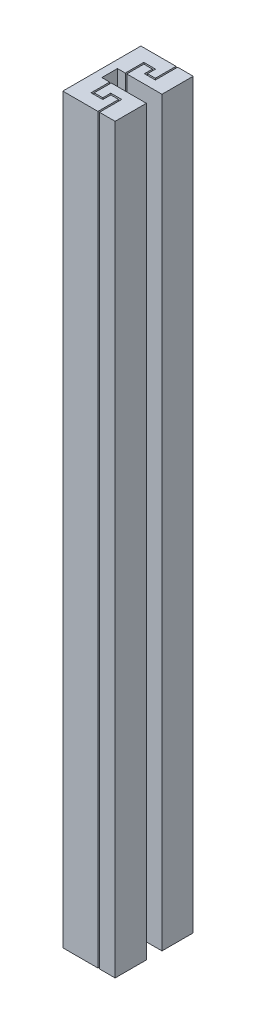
ISO-10303-21;
HEADER;
FILE_DESCRIPTION(('STEP AP214'),'2;1');
FILE_NAME('part.step','',(''),(''),'','','');
FILE_SCHEMA(('AUTOMOTIVE_DESIGN { 1 0 10303 214 1 1 1 1 }'));
ENDSEC;
DATA;
#1=APPLICATION_CONTEXT('core data for automotive mechanical design processes');
#2=APPLICATION_PROTOCOL_DEFINITION('international standard','automotive_design',2000,#1);
#3=PRODUCT_CONTEXT('',#1,'mechanical');
#4=PRODUCT('Part','Part','',(#3));
#5=PRODUCT_RELATED_PRODUCT_CATEGORY('part','',(#4));
#6=PRODUCT_DEFINITION_FORMATION('','',#4);
#7=PRODUCT_DEFINITION_CONTEXT('part definition',#1,'design');
#8=PRODUCT_DEFINITION('design','',#6,#7);
#9=PRODUCT_DEFINITION_SHAPE('','',#8);
#10=(LENGTH_UNIT() NAMED_UNIT(*) SI_UNIT(.MILLI.,.METRE.));
#11=(NAMED_UNIT(*) PLANE_ANGLE_UNIT() SI_UNIT($,.RADIAN.));
#12=(NAMED_UNIT(*) SI_UNIT($,.STERADIAN.) SOLID_ANGLE_UNIT());
#13=UNCERTAINTY_MEASURE_WITH_UNIT(LENGTH_MEASURE(1.E-05),#10,'distance_accuracy_value','');
#14=(GEOMETRIC_REPRESENTATION_CONTEXT(3) GLOBAL_UNCERTAINTY_ASSIGNED_CONTEXT((#13)) GLOBAL_UNIT_ASSIGNED_CONTEXT((#10,
#11,#12)) REPRESENTATION_CONTEXT('',''));
#15=CARTESIAN_POINT('',(0.,0.,0.));
#16=DIRECTION('',(0.,0.,1.));
#17=DIRECTION('',(1.,0.,0.));
#18=AXIS2_PLACEMENT_3D('',#15,#16,#17);
#19=CARTESIAN_POINT('',(-0.127000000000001,241.3,2.54));
#20=DIRECTION('',(0.,0.,1.));
#21=DIRECTION('',(1.,0.,0.));
#22=AXIS2_PLACEMENT_3D('',#19,#20,#21);
#23=PLANE('',#22);
#24=DIRECTION('',(-1.,0.,0.));
#25=VECTOR('',#24,1.);
#26=CARTESIAN_POINT('',(-0.127000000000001,0.,2.54));
#27=LINE('',#26,#25);
#28=CARTESIAN_POINT('',(11.303,0.,2.54));
#29=VERTEX_POINT('',#28);
#30=CARTESIAN_POINT('',(-0.127000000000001,0.,2.54));
#31=VERTEX_POINT('',#30);
#32=EDGE_CURVE('E146',#29,#31,#27,.T.);
#33=ORIENTED_EDGE('',*,*,#32,.T.);
#34=DIRECTION('',(0.,-1.,0.));
#35=VECTOR('',#34,1.);
#36=CARTESIAN_POINT('',(-0.127000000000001,241.3,2.54));
#37=LINE('',#36,#35);
#38=CARTESIAN_POINT('',(-0.127000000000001,241.3,2.54));
#39=VERTEX_POINT('',#38);
#40=EDGE_CURVE('E12',#39,#31,#37,.T.);
#41=ORIENTED_EDGE('',*,*,#40,.F.);
#42=DIRECTION('',(-1.,0.,0.));
#43=VECTOR('',#42,1.);
#44=CARTESIAN_POINT('',(-0.127000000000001,241.3,2.54));
#45=LINE('',#44,#43);
#46=CARTESIAN_POINT('',(11.303,241.3,2.54));
#47=VERTEX_POINT('',#46);
#48=EDGE_CURVE('E160',#47,#39,#45,.T.);
#49=ORIENTED_EDGE('',*,*,#48,.F.);
#50=DIRECTION('',(0.,-1.,0.));
#51=VECTOR('',#50,1.);
#52=CARTESIAN_POINT('',(11.303,241.3,2.54));
#53=LINE('',#52,#51);
#54=EDGE_CURVE('E142',#47,#29,#53,.T.);
#55=ORIENTED_EDGE('',*,*,#54,.T.);
#56=EDGE_LOOP('',(#33,#41,#49,#55));
#57=FACE_BOUND('',#56,.T.);
#58=ADVANCED_FACE('F50',(#57),#23,.F.);
#59=CARTESIAN_POINT('',(-0.127000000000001,241.3,2.54));
#60=DIRECTION('',(1.,0.,0.));
#61=DIRECTION('',(0.,0.,-1.));
#62=AXIS2_PLACEMENT_3D('',#59,#60,#61);
#63=PLANE('',#62);
#64=DIRECTION('',(0.,0.,1.));
#65=VECTOR('',#64,1.);
#66=CARTESIAN_POINT('',(-0.127000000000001,0.,2.54));
#67=LINE('',#66,#65);
#68=CARTESIAN_POINT('',(-0.127,0.,8.07182308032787));
#69=VERTEX_POINT('',#68);
#70=EDGE_CURVE('E149',#31,#69,#67,.T.);
#71=ORIENTED_EDGE('',*,*,#70,.T.);
#72=DIRECTION('',(0.,-1.,0.));
#73=VECTOR('',#72,1.);
#74=CARTESIAN_POINT('',(-0.127,241.3,8.07182308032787));
#75=LINE('',#74,#73);
#76=CARTESIAN_POINT('',(-0.127,241.3,8.07182308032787));
#77=VERTEX_POINT('',#76);
#78=EDGE_CURVE('E58',#77,#69,#75,.T.);
#79=ORIENTED_EDGE('',*,*,#78,.F.);
#80=DIRECTION('',(0.,0.,1.));
#81=VECTOR('',#80,1.);
#82=CARTESIAN_POINT('',(-0.127000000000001,241.3,2.54));
#83=LINE('',#82,#81);
#84=EDGE_CURVE('E109',#39,#77,#83,.T.);
#85=ORIENTED_EDGE('',*,*,#84,.F.);
#86=ORIENTED_EDGE('',*,*,#40,.T.);
#87=EDGE_LOOP('',(#71,#79,#85,#86));
#88=FACE_BOUND('',#87,.T.);
#89=ADVANCED_FACE('F195',(#88),#63,.F.);
#90=CARTESIAN_POINT('',(-0.127,241.3,8.07182308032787));
#91=DIRECTION('',(0.,0.,-1.));
#92=DIRECTION('',(-1.,0.,0.));
#93=AXIS2_PLACEMENT_3D('',#90,#91,#92);
#94=PLANE('',#93);
#95=DIRECTION('',(1.,0.,0.));
#96=VECTOR('',#95,1.);
#97=CARTESIAN_POINT('',(-0.127,0.,8.07182308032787));
#98=LINE('',#97,#96);
#99=CARTESIAN_POINT('',(2.667,0.,8.07182308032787));
#100=VERTEX_POINT('',#99);
#101=EDGE_CURVE('E151',#69,#100,#98,.T.);
#102=ORIENTED_EDGE('',*,*,#101,.T.);
#103=DIRECTION('',(0.,-1.,0.));
#104=VECTOR('',#103,1.);
#105=CARTESIAN_POINT('',(2.667,241.3,8.07182308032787));
#106=LINE('',#105,#104);
#107=CARTESIAN_POINT('',(2.667,241.3,8.07182308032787));
#108=VERTEX_POINT('',#107);
#109=EDGE_CURVE('E167',#108,#100,#106,.T.);
#110=ORIENTED_EDGE('',*,*,#109,.F.);
#111=DIRECTION('',(1.,0.,0.));
#112=VECTOR('',#111,1.);
#113=CARTESIAN_POINT('',(-0.127,241.3,8.07182308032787));
#114=LINE('',#113,#112);
#115=EDGE_CURVE('E175',#77,#108,#114,.T.);
#116=ORIENTED_EDGE('',*,*,#115,.F.);
#117=ORIENTED_EDGE('',*,*,#78,.T.);
#118=EDGE_LOOP('',(#102,#110,#116,#117));
#119=FACE_BOUND('',#118,.T.);
#120=ADVANCED_FACE('F173',(#119),#94,.F.);
#121=CARTESIAN_POINT('',(2.667,241.3,8.07182308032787));
#122=DIRECTION('',(-1.,0.,0.));
#123=DIRECTION('',(0.,0.,1.));
#124=AXIS2_PLACEMENT_3D('',#121,#122,#123);
#125=PLANE('',#124);
#126=DIRECTION('',(0.,0.,-1.));
#127=VECTOR('',#126,1.);
#128=CARTESIAN_POINT('',(2.667,0.,8.07182308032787));
#129=LINE('',#128,#127);
#130=CARTESIAN_POINT('',(2.667,0.,5.47207314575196));
#131=VERTEX_POINT('',#130);
#132=EDGE_CURVE('E153',#100,#131,#129,.T.);
#133=ORIENTED_EDGE('',*,*,#132,.T.);
#134=DIRECTION('',(0.,-1.,0.));
#135=VECTOR('',#134,1.);
#136=CARTESIAN_POINT('',(2.667,241.3,5.47207314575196));
#137=LINE('',#136,#135);
#138=CARTESIAN_POINT('',(2.667,241.3,5.47207314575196));
#139=VERTEX_POINT('',#138);
#140=EDGE_CURVE('E164',#139,#131,#137,.T.);
#141=ORIENTED_EDGE('',*,*,#140,.F.);
#142=DIRECTION('',(0.,0.,-1.));
#143=VECTOR('',#142,1.);
#144=CARTESIAN_POINT('',(2.667,241.3,8.07182308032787));
#145=LINE('',#144,#143);
#146=EDGE_CURVE('E187',#108,#139,#145,.T.);
#147=ORIENTED_EDGE('',*,*,#146,.F.);
#148=ORIENTED_EDGE('',*,*,#109,.T.);
#149=EDGE_LOOP('',(#133,#141,#147,#148));
#150=FACE_BOUND('',#149,.T.);
#151=ADVANCED_FACE('F183',(#150),#125,.F.);
#152=CARTESIAN_POINT('',(2.667,241.3,5.47207314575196));
#153=DIRECTION('',(0.,0.,-1.));
#154=DIRECTION('',(-1.,0.,0.));
#155=AXIS2_PLACEMENT_3D('',#152,#153,#154);
#156=PLANE('',#155);
#157=DIRECTION('',(1.,0.,0.));
#158=VECTOR('',#157,1.);
#159=CARTESIAN_POINT('',(2.667,0.,5.47207314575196));
#160=LINE('',#159,#158);
#161=CARTESIAN_POINT('',(6.223,0.,5.47207314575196));
#162=VERTEX_POINT('',#161);
#163=EDGE_CURVE('E155',#131,#162,#160,.T.);
#164=ORIENTED_EDGE('',*,*,#163,.T.);
#165=DIRECTION('',(0.,-1.,0.));
#166=VECTOR('',#165,1.);
#167=CARTESIAN_POINT('',(6.223,241.3,5.47207314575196));
#168=LINE('',#167,#166);
#169=CARTESIAN_POINT('',(6.223,241.3,5.47207314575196));
#170=VERTEX_POINT('',#169);
#171=EDGE_CURVE('E137',#170,#162,#168,.T.);
#172=ORIENTED_EDGE('',*,*,#171,.F.);
#173=DIRECTION('',(1.,0.,0.));
#174=VECTOR('',#173,1.);
#175=CARTESIAN_POINT('',(2.667,241.3,5.47207314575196));
#176=LINE('',#175,#174);
#177=EDGE_CURVE('E128',#139,#170,#176,.T.);
#178=ORIENTED_EDGE('',*,*,#177,.F.);
#179=ORIENTED_EDGE('',*,*,#140,.T.);
#180=EDGE_LOOP('',(#164,#172,#178,#179));
#181=FACE_BOUND('',#180,.T.);
#182=ADVANCED_FACE('F186',(#181),#156,.F.);
#183=CARTESIAN_POINT('',(6.223,241.3,5.47207314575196));
#184=DIRECTION('',(1.,0.,0.));
#185=DIRECTION('',(0.,0.,-1.));
#186=AXIS2_PLACEMENT_3D('',#183,#184,#185);
#187=PLANE('',#186);
#188=DIRECTION('',(0.,0.,1.));
#189=VECTOR('',#188,1.);
#190=CARTESIAN_POINT('',(6.223,0.,5.47207314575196));
#191=LINE('',#190,#189);
#192=CARTESIAN_POINT('',(6.223,0.,12.7));
#193=VERTEX_POINT('',#192);
#194=EDGE_CURVE('E136',#162,#193,#191,.T.);
#195=ORIENTED_EDGE('',*,*,#194,.T.);
#196=DIRECTION('',(0.,-1.,0.));
#197=VECTOR('',#196,1.);
#198=CARTESIAN_POINT('',(6.223,241.3,12.7));
#199=LINE('',#198,#197);
#200=CARTESIAN_POINT('',(6.223,241.3,12.7));
#201=VERTEX_POINT('',#200);
#202=EDGE_CURVE('E133',#201,#193,#199,.T.);
#203=ORIENTED_EDGE('',*,*,#202,.F.);
#204=DIRECTION('',(0.,0.,1.));
#205=VECTOR('',#204,1.);
#206=CARTESIAN_POINT('',(6.223,241.3,5.47207314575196));
#207=LINE('',#206,#205);
#208=EDGE_CURVE('E122',#170,#201,#207,.T.);
#209=ORIENTED_EDGE('',*,*,#208,.F.);
#210=ORIENTED_EDGE('',*,*,#171,.T.);
#211=EDGE_LOOP('',(#195,#203,#209,#210));
#212=FACE_BOUND('',#211,.T.);
#213=ADVANCED_FACE('F134',(#212),#187,.F.);
#214=CARTESIAN_POINT('',(11.303,241.3,12.7));
#215=DIRECTION('',(0.,0.,-1.));
#216=DIRECTION('',(-1.,0.,0.));
#217=AXIS2_PLACEMENT_3D('',#214,#215,#216);
#218=PLANE('',#217);
#219=DIRECTION('',(1.,0.,0.));
#220=VECTOR('',#219,1.);
#221=CARTESIAN_POINT('',(11.303,0.,12.7));
#222=LINE('',#221,#220);
#223=CARTESIAN_POINT('',(11.303,0.,12.7));
#224=VERTEX_POINT('',#223);
#225=EDGE_CURVE('E95',#193,#224,#222,.T.);
#226=ORIENTED_EDGE('',*,*,#225,.T.);
#227=DIRECTION('',(0.,-1.,0.));
#228=VECTOR('',#227,1.);
#229=CARTESIAN_POINT('',(11.303,241.3,12.7));
#230=LINE('',#229,#228);
#231=CARTESIAN_POINT('',(11.303,241.3,12.7));
#232=VERTEX_POINT('',#231);
#233=EDGE_CURVE('E138',#232,#224,#230,.T.);
#234=ORIENTED_EDGE('',*,*,#233,.F.);
#235=DIRECTION('',(1.,0.,0.));
#236=VECTOR('',#235,1.);
#237=CARTESIAN_POINT('',(11.303,241.3,12.7));
#238=LINE('',#237,#236);
#239=EDGE_CURVE('E126',#201,#232,#238,.T.);
#240=ORIENTED_EDGE('',*,*,#239,.F.);
#241=ORIENTED_EDGE('',*,*,#202,.T.);
#242=EDGE_LOOP('',(#226,#234,#240,#241));
#243=FACE_BOUND('',#242,.T.);
#244=ADVANCED_FACE('F140',(#243),#218,.F.);
#245=CARTESIAN_POINT('',(11.303,241.3,2.54));
#246=DIRECTION('',(-1.,0.,0.));
#247=DIRECTION('',(0.,0.,1.));
#248=AXIS2_PLACEMENT_3D('',#245,#246,#247);
#249=PLANE('',#248);
#250=DIRECTION('',(0.,0.,-1.));
#251=VECTOR('',#250,1.);
#252=CARTESIAN_POINT('',(11.303,0.,2.54));
#253=LINE('',#252,#251);
#254=EDGE_CURVE('E101',#224,#29,#253,.T.);
#255=ORIENTED_EDGE('',*,*,#254,.T.);
#256=ORIENTED_EDGE('',*,*,#54,.F.);
#257=DIRECTION('',(0.,0.,-1.));
#258=VECTOR('',#257,1.);
#259=CARTESIAN_POINT('',(11.303,241.3,2.54));
#260=LINE('',#259,#258);
#261=EDGE_CURVE('E66',#232,#47,#260,.T.);
#262=ORIENTED_EDGE('',*,*,#261,.F.);
#263=ORIENTED_EDGE('',*,*,#233,.T.);
#264=EDGE_LOOP('',(#255,#256,#262,#263));
#265=FACE_BOUND('',#264,.T.);
#266=ADVANCED_FACE('F211',(#265),#249,.F.);
#267=CARTESIAN_POINT('',(0.,241.3,0.));
#268=DIRECTION('',(0.,-1.,0.));
#269=DIRECTION('',(0.,0.,-1.));
#270=AXIS2_PLACEMENT_3D('',#267,#268,#269);
#271=PLANE('',#270);
#272=ORIENTED_EDGE('',*,*,#48,.T.);
#273=ORIENTED_EDGE('',*,*,#84,.T.);
#274=ORIENTED_EDGE('',*,*,#115,.T.);
#275=ORIENTED_EDGE('',*,*,#146,.T.);
#276=ORIENTED_EDGE('',*,*,#177,.T.);
#277=ORIENTED_EDGE('',*,*,#208,.T.);
#278=ORIENTED_EDGE('',*,*,#239,.T.);
#279=ORIENTED_EDGE('',*,*,#261,.T.);
#280=EDGE_LOOP('',(#272,#273,#274,#275,#276,#277,#278,#279));
#281=FACE_BOUND('',#280,.T.);
#282=ADVANCED_FACE('F124',(#281),#271,.F.);
#283=CARTESIAN_POINT('',(0.,0.,0.));
#284=DIRECTION('',(0.,-1.,0.));
#285=DIRECTION('',(0.,0.,-1.));
#286=AXIS2_PLACEMENT_3D('',#283,#284,#285);
#287=PLANE('',#286);
#288=ORIENTED_EDGE('',*,*,#32,.F.);
#289=ORIENTED_EDGE('',*,*,#254,.F.);
#290=ORIENTED_EDGE('',*,*,#225,.F.);
#291=ORIENTED_EDGE('',*,*,#194,.F.);
#292=ORIENTED_EDGE('',*,*,#163,.F.);
#293=ORIENTED_EDGE('',*,*,#132,.F.);
#294=ORIENTED_EDGE('',*,*,#101,.F.);
#295=ORIENTED_EDGE('',*,*,#70,.F.);
#296=EDGE_LOOP('',(#288,#289,#290,#291,#292,#293,#294,#295));
#297=FACE_BOUND('',#296,.T.);
#298=ADVANCED_FACE('F179',(#297),#287,.T.);
#299=CLOSED_SHELL('',(#58,#89,#120,#151,#182,#213,#244,#266,#282,#298));
#300=MANIFOLD_SOLID_BREP('B2',#299);
#301=CARTESIAN_POINT('',(-0.127000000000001,241.3,-2.54));
#302=DIRECTION('',(0.,0.,-1.));
#303=DIRECTION('',(-1.,0.,0.));
#304=AXIS2_PLACEMENT_3D('',#301,#302,#303);
#305=PLANE('',#304);
#306=DIRECTION('',(1.,0.,0.));
#307=VECTOR('',#306,1.);
#308=CARTESIAN_POINT('',(-0.127000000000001,0.,-2.54));
#309=LINE('',#308,#307);
#310=CARTESIAN_POINT('',(-0.127000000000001,0.,-2.54));
#311=VERTEX_POINT('',#310);
#312=CARTESIAN_POINT('',(11.303,0.,-2.54));
#313=VERTEX_POINT('',#312);
#314=EDGE_CURVE('E383',#311,#313,#309,.T.);
#315=ORIENTED_EDGE('',*,*,#314,.T.);
#316=DIRECTION('',(0.,-1.,0.));
#317=VECTOR('',#316,1.);
#318=CARTESIAN_POINT('',(11.303,241.3,-2.54));
#319=LINE('',#318,#317);
#320=CARTESIAN_POINT('',(11.303,241.3,-2.54));
#321=VERTEX_POINT('',#320);
#322=EDGE_CURVE('E48',#321,#313,#319,.T.);
#323=ORIENTED_EDGE('',*,*,#322,.F.);
#324=DIRECTION('',(1.,0.,0.));
#325=VECTOR('',#324,1.);
#326=CARTESIAN_POINT('',(-0.127000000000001,241.3,-2.54));
#327=LINE('',#326,#325);
#328=CARTESIAN_POINT('',(-0.127000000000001,241.3,-2.54));
#329=VERTEX_POINT('',#328);
#330=EDGE_CURVE('E397',#329,#321,#327,.T.);
#331=ORIENTED_EDGE('',*,*,#330,.F.);
#332=DIRECTION('',(0.,-1.,0.));
#333=VECTOR('',#332,1.);
#334=CARTESIAN_POINT('',(-0.127000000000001,241.3,-2.54));
#335=LINE('',#334,#333);
#336=EDGE_CURVE('E379',#329,#311,#335,.T.);
#337=ORIENTED_EDGE('',*,*,#336,.T.);
#338=EDGE_LOOP('',(#315,#323,#331,#337));
#339=FACE_BOUND('',#338,.T.);
#340=ADVANCED_FACE('F287',(#339),#305,.F.);
#341=CARTESIAN_POINT('',(11.303,241.3,-2.54));
#342=DIRECTION('',(-1.,0.,0.));
#343=DIRECTION('',(0.,0.,1.));
#344=AXIS2_PLACEMENT_3D('',#341,#342,#343);
#345=PLANE('',#344);
#346=DIRECTION('',(0.,0.,-1.));
#347=VECTOR('',#346,1.);
#348=CARTESIAN_POINT('',(11.303,0.,-2.54));
#349=LINE('',#348,#347);
#350=CARTESIAN_POINT('',(11.303,0.,-12.7));
#351=VERTEX_POINT('',#350);
#352=EDGE_CURVE('E386',#313,#351,#349,.T.);
#353=ORIENTED_EDGE('',*,*,#352,.T.);
#354=DIRECTION('',(0.,-1.,0.));
#355=VECTOR('',#354,1.);
#356=CARTESIAN_POINT('',(11.303,241.3,-12.7));
#357=LINE('',#356,#355);
#358=CARTESIAN_POINT('',(11.303,241.3,-12.7));
#359=VERTEX_POINT('',#358);
#360=EDGE_CURVE('E295',#359,#351,#357,.T.);
#361=ORIENTED_EDGE('',*,*,#360,.F.);
#362=DIRECTION('',(0.,0.,-1.));
#363=VECTOR('',#362,1.);
#364=CARTESIAN_POINT('',(11.303,241.3,-2.54));
#365=LINE('',#364,#363);
#366=EDGE_CURVE('E346',#321,#359,#365,.T.);
#367=ORIENTED_EDGE('',*,*,#366,.F.);
#368=ORIENTED_EDGE('',*,*,#322,.T.);
#369=EDGE_LOOP('',(#353,#361,#367,#368));
#370=FACE_BOUND('',#369,.T.);
#371=ADVANCED_FACE('F432',(#370),#345,.F.);
#372=CARTESIAN_POINT('',(11.303,241.3,-12.7));
#373=DIRECTION('',(0.,0.,1.));
#374=DIRECTION('',(1.,0.,0.));
#375=AXIS2_PLACEMENT_3D('',#372,#373,#374);
#376=PLANE('',#375);
#377=DIRECTION('',(-1.,0.,0.));
#378=VECTOR('',#377,1.);
#379=CARTESIAN_POINT('',(11.303,0.,-12.7));
#380=LINE('',#379,#378);
#381=CARTESIAN_POINT('',(6.223,0.,-12.7));
#382=VERTEX_POINT('',#381);
#383=EDGE_CURVE('E388',#351,#382,#380,.T.);
#384=ORIENTED_EDGE('',*,*,#383,.T.);
#385=DIRECTION('',(0.,-1.,0.));
#386=VECTOR('',#385,1.);
#387=CARTESIAN_POINT('',(6.223,241.3,-12.7));
#388=LINE('',#387,#386);
#389=CARTESIAN_POINT('',(6.223,241.3,-12.7));
#390=VERTEX_POINT('',#389);
#391=EDGE_CURVE('E404',#390,#382,#388,.T.);
#392=ORIENTED_EDGE('',*,*,#391,.F.);
#393=DIRECTION('',(-1.,0.,0.));
#394=VECTOR('',#393,1.);
#395=CARTESIAN_POINT('',(11.303,241.3,-12.7));
#396=LINE('',#395,#394);
#397=EDGE_CURVE('E412',#359,#390,#396,.T.);
#398=ORIENTED_EDGE('',*,*,#397,.F.);
#399=ORIENTED_EDGE('',*,*,#360,.T.);
#400=EDGE_LOOP('',(#384,#392,#398,#399));
#401=FACE_BOUND('',#400,.T.);
#402=ADVANCED_FACE('F410',(#401),#376,.F.);
#403=CARTESIAN_POINT('',(6.223,241.3,-5.47207314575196));
#404=DIRECTION('',(1.,0.,0.));
#405=DIRECTION('',(0.,0.,-1.));
#406=AXIS2_PLACEMENT_3D('',#403,#404,#405);
#407=PLANE('',#406);
#408=DIRECTION('',(0.,0.,1.));
#409=VECTOR('',#408,1.);
#410=CARTESIAN_POINT('',(6.223,0.,-5.47207314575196));
#411=LINE('',#410,#409);
#412=CARTESIAN_POINT('',(6.223,0.,-5.47207314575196));
#413=VERTEX_POINT('',#412);
#414=EDGE_CURVE('E390',#382,#413,#411,.T.);
#415=ORIENTED_EDGE('',*,*,#414,.T.);
#416=DIRECTION('',(0.,-1.,0.));
#417=VECTOR('',#416,1.);
#418=CARTESIAN_POINT('',(6.223,241.3,-5.47207314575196));
#419=LINE('',#418,#417);
#420=CARTESIAN_POINT('',(6.223,241.3,-5.47207314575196));
#421=VERTEX_POINT('',#420);
#422=EDGE_CURVE('E401',#421,#413,#419,.T.);
#423=ORIENTED_EDGE('',*,*,#422,.F.);
#424=DIRECTION('',(0.,0.,1.));
#425=VECTOR('',#424,1.);
#426=CARTESIAN_POINT('',(6.223,241.3,-5.47207314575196));
#427=LINE('',#426,#425);
#428=EDGE_CURVE('E424',#390,#421,#427,.T.);
#429=ORIENTED_EDGE('',*,*,#428,.F.);
#430=ORIENTED_EDGE('',*,*,#391,.T.);
#431=EDGE_LOOP('',(#415,#423,#429,#430));
#432=FACE_BOUND('',#431,.T.);
#433=ADVANCED_FACE('F420',(#432),#407,.F.);
#434=CARTESIAN_POINT('',(2.667,241.3,-5.47207314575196));
#435=DIRECTION('',(0.,0.,1.));
#436=DIRECTION('',(1.,0.,0.));
#437=AXIS2_PLACEMENT_3D('',#434,#435,#436);
#438=PLANE('',#437);
#439=DIRECTION('',(-1.,0.,0.));
#440=VECTOR('',#439,1.);
#441=CARTESIAN_POINT('',(2.667,0.,-5.47207314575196));
#442=LINE('',#441,#440);
#443=CARTESIAN_POINT('',(2.667,0.,-5.47207314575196));
#444=VERTEX_POINT('',#443);
#445=EDGE_CURVE('E392',#413,#444,#442,.T.);
#446=ORIENTED_EDGE('',*,*,#445,.T.);
#447=DIRECTION('',(0.,-1.,0.));
#448=VECTOR('',#447,1.);
#449=CARTESIAN_POINT('',(2.667,241.3,-5.47207314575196));
#450=LINE('',#449,#448);
#451=CARTESIAN_POINT('',(2.667,241.3,-5.47207314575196));
#452=VERTEX_POINT('',#451);
#453=EDGE_CURVE('E374',#452,#444,#450,.T.);
#454=ORIENTED_EDGE('',*,*,#453,.F.);
#455=DIRECTION('',(-1.,0.,0.));
#456=VECTOR('',#455,1.);
#457=CARTESIAN_POINT('',(2.667,241.3,-5.47207314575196));
#458=LINE('',#457,#456);
#459=EDGE_CURVE('E365',#421,#452,#458,.T.);
#460=ORIENTED_EDGE('',*,*,#459,.F.);
#461=ORIENTED_EDGE('',*,*,#422,.T.);
#462=EDGE_LOOP('',(#446,#454,#460,#461));
#463=FACE_BOUND('',#462,.T.);
#464=ADVANCED_FACE('F423',(#463),#438,.F.);
#465=CARTESIAN_POINT('',(2.667,241.3,-8.07182308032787));
#466=DIRECTION('',(-1.,0.,0.));
#467=DIRECTION('',(0.,0.,1.));
#468=AXIS2_PLACEMENT_3D('',#465,#466,#467);
#469=PLANE('',#468);
#470=DIRECTION('',(0.,0.,-1.));
#471=VECTOR('',#470,1.);
#472=CARTESIAN_POINT('',(2.667,0.,-8.07182308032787));
#473=LINE('',#472,#471);
#474=CARTESIAN_POINT('',(2.667,0.,-8.07182308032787));
#475=VERTEX_POINT('',#474);
#476=EDGE_CURVE('E373',#444,#475,#473,.T.);
#477=ORIENTED_EDGE('',*,*,#476,.T.);
#478=DIRECTION('',(0.,-1.,0.));
#479=VECTOR('',#478,1.);
#480=CARTESIAN_POINT('',(2.667,241.3,-8.07182308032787));
#481=LINE('',#480,#479);
#482=CARTESIAN_POINT('',(2.667,241.3,-8.07182308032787));
#483=VERTEX_POINT('',#482);
#484=EDGE_CURVE('E370',#483,#475,#481,.T.);
#485=ORIENTED_EDGE('',*,*,#484,.F.);
#486=DIRECTION('',(0.,0.,-1.));
#487=VECTOR('',#486,1.);
#488=CARTESIAN_POINT('',(2.667,241.3,-8.07182308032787));
#489=LINE('',#488,#487);
#490=EDGE_CURVE('E359',#452,#483,#489,.T.);
#491=ORIENTED_EDGE('',*,*,#490,.F.);
#492=ORIENTED_EDGE('',*,*,#453,.T.);
#493=EDGE_LOOP('',(#477,#485,#491,#492));
#494=FACE_BOUND('',#493,.T.);
#495=ADVANCED_FACE('F371',(#494),#469,.F.);
#496=CARTESIAN_POINT('',(-0.127000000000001,241.3,-8.07182308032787));
#497=DIRECTION('',(0.,0.,1.));
#498=DIRECTION('',(1.,0.,0.));
#499=AXIS2_PLACEMENT_3D('',#496,#497,#498);
#500=PLANE('',#499);
#501=DIRECTION('',(-1.,0.,0.));
#502=VECTOR('',#501,1.);
#503=CARTESIAN_POINT('',(-0.127000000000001,0.,-8.07182308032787));
#504=LINE('',#503,#502);
#505=CARTESIAN_POINT('',(-0.127000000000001,0.,-8.07182308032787));
#506=VERTEX_POINT('',#505);
#507=EDGE_CURVE('E332',#475,#506,#504,.T.);
#508=ORIENTED_EDGE('',*,*,#507,.T.);
#509=DIRECTION('',(0.,-1.,0.));
#510=VECTOR('',#509,1.);
#511=CARTESIAN_POINT('',(-0.127000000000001,241.3,-8.07182308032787));
#512=LINE('',#511,#510);
#513=CARTESIAN_POINT('',(-0.127000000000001,241.3,-8.07182308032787));
#514=VERTEX_POINT('',#513);
#515=EDGE_CURVE('E375',#514,#506,#512,.T.);
#516=ORIENTED_EDGE('',*,*,#515,.F.);
#517=DIRECTION('',(-1.,0.,0.));
#518=VECTOR('',#517,1.);
#519=CARTESIAN_POINT('',(-0.127000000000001,241.3,-8.07182308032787));
#520=LINE('',#519,#518);
#521=EDGE_CURVE('E363',#483,#514,#520,.T.);
#522=ORIENTED_EDGE('',*,*,#521,.F.);
#523=ORIENTED_EDGE('',*,*,#484,.T.);
#524=EDGE_LOOP('',(#508,#516,#522,#523));
#525=FACE_BOUND('',#524,.T.);
#526=ADVANCED_FACE('F377',(#525),#500,.F.);
#527=CARTESIAN_POINT('',(-0.127000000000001,241.3,-2.54));
#528=DIRECTION('',(1.,0.,0.));
#529=DIRECTION('',(0.,0.,-1.));
#530=AXIS2_PLACEMENT_3D('',#527,#528,#529);
#531=PLANE('',#530);
#532=DIRECTION('',(0.,0.,1.));
#533=VECTOR('',#532,1.);
#534=CARTESIAN_POINT('',(-0.127000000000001,0.,-2.54));
#535=LINE('',#534,#533);
#536=EDGE_CURVE('E338',#506,#311,#535,.T.);
#537=ORIENTED_EDGE('',*,*,#536,.T.);
#538=ORIENTED_EDGE('',*,*,#336,.F.);
#539=DIRECTION('',(0.,0.,1.));
#540=VECTOR('',#539,1.);
#541=CARTESIAN_POINT('',(-0.127000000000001,241.3,-2.54));
#542=LINE('',#541,#540);
#543=EDGE_CURVE('E303',#514,#329,#542,.T.);
#544=ORIENTED_EDGE('',*,*,#543,.F.);
#545=ORIENTED_EDGE('',*,*,#515,.T.);
#546=EDGE_LOOP('',(#537,#538,#544,#545));
#547=FACE_BOUND('',#546,.T.);
#548=ADVANCED_FACE('F448',(#547),#531,.F.);
#549=CARTESIAN_POINT('',(0.,241.3,0.));
#550=DIRECTION('',(0.,1.,0.));
#551=DIRECTION('',(0.,0.,1.));
#552=AXIS2_PLACEMENT_3D('',#549,#550,#551);
#553=PLANE('',#552);
#554=ORIENTED_EDGE('',*,*,#330,.T.);
#555=ORIENTED_EDGE('',*,*,#366,.T.);
#556=ORIENTED_EDGE('',*,*,#397,.T.);
#557=ORIENTED_EDGE('',*,*,#428,.T.);
#558=ORIENTED_EDGE('',*,*,#459,.T.);
#559=ORIENTED_EDGE('',*,*,#490,.T.);
#560=ORIENTED_EDGE('',*,*,#521,.T.);
#561=ORIENTED_EDGE('',*,*,#543,.T.);
#562=EDGE_LOOP('',(#554,#555,#556,#557,#558,#559,#560,#561));
#563=FACE_BOUND('',#562,.T.);
#564=ADVANCED_FACE('F361',(#563),#553,.T.);
#565=CARTESIAN_POINT('',(0.,0.,0.));
#566=DIRECTION('',(0.,1.,0.));
#567=DIRECTION('',(0.,0.,1.));
#568=AXIS2_PLACEMENT_3D('',#565,#566,#567);
#569=PLANE('',#568);
#570=ORIENTED_EDGE('',*,*,#314,.F.);
#571=ORIENTED_EDGE('',*,*,#536,.F.);
#572=ORIENTED_EDGE('',*,*,#507,.F.);
#573=ORIENTED_EDGE('',*,*,#476,.F.);
#574=ORIENTED_EDGE('',*,*,#445,.F.);
#575=ORIENTED_EDGE('',*,*,#414,.F.);
#576=ORIENTED_EDGE('',*,*,#383,.F.);
#577=ORIENTED_EDGE('',*,*,#352,.F.);
#578=EDGE_LOOP('',(#570,#571,#572,#573,#574,#575,#576,#577));
#579=FACE_BOUND('',#578,.T.);
#580=ADVANCED_FACE('F416',(#579),#569,.F.);
#581=CLOSED_SHELL('',(#340,#371,#402,#433,#464,#495,#526,#548,#564,#580));
#582=MANIFOLD_SOLID_BREP('B6',#581);
#583=CARTESIAN_POINT('',(5.715,241.3,-12.7));
#584=DIRECTION('',(-1.,0.,0.));
#585=DIRECTION('',(0.,0.,1.));
#586=AXIS2_PLACEMENT_3D('',#583,#584,#585);
#587=PLANE('',#586);
#588=DIRECTION('',(0.,0.,-1.));
#589=VECTOR('',#588,1.);
#590=CARTESIAN_POINT('',(5.715,0.,-12.7));
#591=LINE('',#590,#589);
#592=CARTESIAN_POINT('',(5.715,0.,12.7));
#593=VERTEX_POINT('',#592);
#594=CARTESIAN_POINT('',(5.715,0.,5.98007314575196));
#595=VERTEX_POINT('',#594);
#596=EDGE_CURVE('E740',#593,#595,#591,.T.);
#597=ORIENTED_EDGE('',*,*,#596,.T.);
#598=DIRECTION('',(0.,1.,0.));
#599=VECTOR('',#598,1.);
#600=CARTESIAN_POINT('',(5.715,241.3,5.98007314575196));
#601=LINE('',#600,#599);
#602=CARTESIAN_POINT('',(5.715,241.3,5.98007314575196));
#603=VERTEX_POINT('',#602);
#604=EDGE_CURVE('E728',#595,#603,#601,.T.);
#605=ORIENTED_EDGE('',*,*,#604,.T.);
#606=DIRECTION('',(0.,0.,-1.));
#607=VECTOR('',#606,1.);
#608=CARTESIAN_POINT('',(5.715,241.3,-12.7));
#609=LINE('',#608,#607);
#610=CARTESIAN_POINT('',(5.715,241.3,12.7));
#611=VERTEX_POINT('',#610);
#612=EDGE_CURVE('E732',#611,#603,#609,.T.);
#613=ORIENTED_EDGE('',*,*,#612,.F.);
#614=DIRECTION('',(0.,-1.,0.));
#615=VECTOR('',#614,1.);
#616=CARTESIAN_POINT('',(5.715,241.3,12.7));
#617=LINE('',#616,#615);
#618=EDGE_CURVE('E739',#611,#593,#617,.T.);
#619=ORIENTED_EDGE('',*,*,#618,.T.);
#620=EDGE_LOOP('',(#597,#605,#613,#619));
#621=FACE_BOUND('',#620,.T.);
#622=ADVANCED_FACE('F515',(#621),#587,.F.);
#623=CARTESIAN_POINT('',(5.715,241.3,-5.98007314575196));
#624=VERTEX_POINT('',#623);
#625=CARTESIAN_POINT('',(5.715,241.3,-12.7));
#626=VERTEX_POINT('',#625);
#627=EDGE_CURVE('E567',#624,#626,#609,.T.);
#628=ORIENTED_EDGE('',*,*,#627,.F.);
#629=DIRECTION('',(0.,-1.,0.));
#630=VECTOR('',#629,1.);
#631=CARTESIAN_POINT('',(5.715,241.3,-5.98007314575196));
#632=LINE('',#631,#630);
#633=CARTESIAN_POINT('',(5.715,0.,-5.98007314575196));
#634=VERTEX_POINT('',#633);
#635=EDGE_CURVE('E709',#624,#634,#632,.T.);
#636=ORIENTED_EDGE('',*,*,#635,.T.);
#637=CARTESIAN_POINT('',(5.715,0.,-12.7));
#638=VERTEX_POINT('',#637);
#639=EDGE_CURVE('E731',#634,#638,#591,.T.);
#640=ORIENTED_EDGE('',*,*,#639,.T.);
#641=DIRECTION('',(0.,-1.,0.));
#642=VECTOR('',#641,1.);
#643=CARTESIAN_POINT('',(5.715,241.3,-12.7));
#644=LINE('',#643,#642);
#645=EDGE_CURVE('E523',#626,#638,#644,.T.);
#646=ORIENTED_EDGE('',*,*,#645,.F.);
#647=EDGE_LOOP('',(#628,#636,#640,#646));
#648=FACE_BOUND('',#647,.T.);
#649=ADVANCED_FACE('F517',(#648),#587,.F.);
#650=CARTESIAN_POINT('',(-5.715,241.3,-12.7));
#651=DIRECTION('',(0.,0.,1.));
#652=DIRECTION('',(1.,0.,0.));
#653=AXIS2_PLACEMENT_3D('',#650,#651,#652);
#654=PLANE('',#653);
#655=DIRECTION('',(-1.,0.,0.));
#656=VECTOR('',#655,1.);
#657=CARTESIAN_POINT('',(-5.715,0.,-12.7));
#658=LINE('',#657,#656);
#659=CARTESIAN_POINT('',(-5.715,0.,-12.7));
#660=VERTEX_POINT('',#659);
#661=EDGE_CURVE('E743',#638,#660,#658,.T.);
#662=ORIENTED_EDGE('',*,*,#661,.T.);
#663=DIRECTION('',(0.,-1.,0.));
#664=VECTOR('',#663,1.);
#665=CARTESIAN_POINT('',(-5.715,241.3,-12.7));
#666=LINE('',#665,#664);
#667=CARTESIAN_POINT('',(-5.715,241.3,-12.7));
#668=VERTEX_POINT('',#667);
#669=EDGE_CURVE('E751',#668,#660,#666,.T.);
#670=ORIENTED_EDGE('',*,*,#669,.F.);
#671=DIRECTION('',(-1.,0.,0.));
#672=VECTOR('',#671,1.);
#673=CARTESIAN_POINT('',(-5.715,241.3,-12.7));
#674=LINE('',#673,#672);
#675=EDGE_CURVE('E734',#626,#668,#674,.T.);
#676=ORIENTED_EDGE('',*,*,#675,.F.);
#677=ORIENTED_EDGE('',*,*,#645,.T.);
#678=EDGE_LOOP('',(#662,#670,#676,#677));
#679=FACE_BOUND('',#678,.T.);
#680=ADVANCED_FACE('F756',(#679),#654,.F.);
#681=CARTESIAN_POINT('',(-5.715,241.3,-12.7));
#682=DIRECTION('',(1.,0.,0.));
#683=DIRECTION('',(0.,0.,-1.));
#684=AXIS2_PLACEMENT_3D('',#681,#682,#683);
#685=PLANE('',#684);
#686=DIRECTION('',(0.,0.,1.));
#687=VECTOR('',#686,1.);
#688=CARTESIAN_POINT('',(-5.715,0.,-12.7));
#689=LINE('',#688,#687);
#690=CARTESIAN_POINT('',(-5.715,0.,12.7));
#691=VERTEX_POINT('',#690);
#692=EDGE_CURVE('E745',#660,#691,#689,.T.);
#693=ORIENTED_EDGE('',*,*,#692,.T.);
#694=DIRECTION('',(0.,-1.,0.));
#695=VECTOR('',#694,1.);
#696=CARTESIAN_POINT('',(-5.715,241.3,12.7));
#697=LINE('',#696,#695);
#698=CARTESIAN_POINT('',(-5.715,241.3,12.7));
#699=VERTEX_POINT('',#698);
#700=EDGE_CURVE('E749',#699,#691,#697,.T.);
#701=ORIENTED_EDGE('',*,*,#700,.F.);
#702=DIRECTION('',(0.,0.,1.));
#703=VECTOR('',#702,1.);
#704=CARTESIAN_POINT('',(-5.715,241.3,-12.7));
#705=LINE('',#704,#703);
#706=EDGE_CURVE('E736',#668,#699,#705,.T.);
#707=ORIENTED_EDGE('',*,*,#706,.F.);
#708=ORIENTED_EDGE('',*,*,#669,.T.);
#709=EDGE_LOOP('',(#693,#701,#707,#708));
#710=FACE_BOUND('',#709,.T.);
#711=ADVANCED_FACE('F769',(#710),#685,.F.);
#712=CARTESIAN_POINT('',(-5.715,241.3,12.7));
#713=DIRECTION('',(0.,0.,-1.));
#714=DIRECTION('',(-1.,0.,0.));
#715=AXIS2_PLACEMENT_3D('',#712,#713,#714);
#716=PLANE('',#715);
#717=DIRECTION('',(1.,0.,0.));
#718=VECTOR('',#717,1.);
#719=CARTESIAN_POINT('',(-5.715,0.,12.7));
#720=LINE('',#719,#718);
#721=EDGE_CURVE('E560',#691,#593,#720,.T.);
#722=ORIENTED_EDGE('',*,*,#721,.T.);
#723=ORIENTED_EDGE('',*,*,#618,.F.);
#724=DIRECTION('',(1.,0.,0.));
#725=VECTOR('',#724,1.);
#726=CARTESIAN_POINT('',(-5.715,241.3,12.7));
#727=LINE('',#726,#725);
#728=EDGE_CURVE('E539',#699,#611,#727,.T.);
#729=ORIENTED_EDGE('',*,*,#728,.F.);
#730=ORIENTED_EDGE('',*,*,#700,.T.);
#731=EDGE_LOOP('',(#722,#723,#729,#730));
#732=FACE_BOUND('',#731,.T.);
#733=ADVANCED_FACE('F771',(#732),#716,.F.);
#734=CARTESIAN_POINT('',(0.,241.3,0.));
#735=DIRECTION('',(0.,1.,0.));
#736=DIRECTION('',(0.,0.,1.));
#737=AXIS2_PLACEMENT_3D('',#734,#735,#736);
#738=PLANE('',#737);
#739=DIRECTION('',(-1.,0.,0.));
#740=VECTOR('',#739,1.);
#741=CARTESIAN_POINT('',(3.175,241.3,5.98007314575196));
#742=LINE('',#741,#740);
#743=CARTESIAN_POINT('',(3.175,241.3,5.98007314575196));
#744=VERTEX_POINT('',#743);
#745=EDGE_CURVE('E677',#603,#744,#742,.T.);
#746=ORIENTED_EDGE('',*,*,#745,.T.);
#747=DIRECTION('',(0.,0.,1.));
#748=VECTOR('',#747,1.);
#749=CARTESIAN_POINT('',(3.175,241.3,8.57982308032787));
#750=LINE('',#749,#748);
#751=CARTESIAN_POINT('',(3.175,241.3,8.57982308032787));
#752=VERTEX_POINT('',#751);
#753=EDGE_CURVE('E679',#744,#752,#750,.T.);
#754=ORIENTED_EDGE('',*,*,#753,.T.);
#755=DIRECTION('',(-1.,0.,0.));
#756=VECTOR('',#755,1.);
#757=CARTESIAN_POINT('',(-0.635000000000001,241.3,8.57982308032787));
#758=LINE('',#757,#756);
#759=CARTESIAN_POINT('',(-0.635000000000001,241.3,8.57982308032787));
#760=VERTEX_POINT('',#759);
#761=EDGE_CURVE('E682',#752,#760,#758,.T.);
#762=ORIENTED_EDGE('',*,*,#761,.T.);
#763=DIRECTION('',(0.,0.,-1.));
#764=VECTOR('',#763,1.);
#765=CARTESIAN_POINT('',(-0.635000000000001,241.3,2.54));
#766=LINE('',#765,#764);
#767=CARTESIAN_POINT('',(-0.635000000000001,241.3,2.54));
#768=VERTEX_POINT('',#767);
#769=EDGE_CURVE('E646',#760,#768,#766,.T.);
#770=ORIENTED_EDGE('',*,*,#769,.T.);
#771=DIRECTION('',(-1.,0.,0.));
#772=VECTOR('',#771,1.);
#773=CARTESIAN_POINT('',(-3.175,241.3,2.54));
#774=LINE('',#773,#772);
#775=CARTESIAN_POINT('',(-3.175,241.3,2.54));
#776=VERTEX_POINT('',#775);
#777=EDGE_CURVE('E640',#768,#776,#774,.T.);
#778=ORIENTED_EDGE('',*,*,#777,.T.);
#779=DIRECTION('',(0.,0.,-1.));
#780=VECTOR('',#779,1.);
#781=CARTESIAN_POINT('',(-3.175,241.3,-2.54));
#782=LINE('',#781,#780);
#783=CARTESIAN_POINT('',(-3.175,241.3,-2.54));
#784=VERTEX_POINT('',#783);
#785=EDGE_CURVE('E649',#776,#784,#782,.T.);
#786=ORIENTED_EDGE('',*,*,#785,.T.);
#787=DIRECTION('',(1.,0.,0.));
#788=VECTOR('',#787,1.);
#789=CARTESIAN_POINT('',(-3.175,241.3,-2.54));
#790=LINE('',#789,#788);
#791=CARTESIAN_POINT('',(-0.635000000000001,241.3,-2.54));
#792=VERTEX_POINT('',#791);
#793=EDGE_CURVE('E653',#784,#792,#790,.T.);
#794=ORIENTED_EDGE('',*,*,#793,.T.);
#795=DIRECTION('',(0.,0.,-1.));
#796=VECTOR('',#795,1.);
#797=CARTESIAN_POINT('',(-0.635000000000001,241.3,-2.54));
#798=LINE('',#797,#796);
#799=CARTESIAN_POINT('',(-0.635000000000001,241.3,-8.57982308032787));
#800=VERTEX_POINT('',#799);
#801=EDGE_CURVE('E666',#792,#800,#798,.T.);
#802=ORIENTED_EDGE('',*,*,#801,.T.);
#803=DIRECTION('',(1.,0.,0.));
#804=VECTOR('',#803,1.);
#805=CARTESIAN_POINT('',(-0.635000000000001,241.3,-8.57982308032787));
#806=LINE('',#805,#804);
#807=CARTESIAN_POINT('',(3.175,241.3,-8.57982308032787));
#808=VERTEX_POINT('',#807);
#809=EDGE_CURVE('E669',#800,#808,#806,.T.);
#810=ORIENTED_EDGE('',*,*,#809,.T.);
#811=DIRECTION('',(0.,0.,1.));
#812=VECTOR('',#811,1.);
#813=CARTESIAN_POINT('',(3.175,241.3,-8.57982308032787));
#814=LINE('',#813,#812);
#815=CARTESIAN_POINT('',(3.175,241.3,-5.98007314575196));
#816=VERTEX_POINT('',#815);
#817=EDGE_CURVE('E672',#808,#816,#814,.T.);
#818=ORIENTED_EDGE('',*,*,#817,.T.);
#819=DIRECTION('',(1.,0.,0.));
#820=VECTOR('',#819,1.);
#821=CARTESIAN_POINT('',(3.175,241.3,-5.98007314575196));
#822=LINE('',#821,#820);
#823=EDGE_CURVE('E675',#816,#624,#822,.T.);
#824=ORIENTED_EDGE('',*,*,#823,.T.);
#825=ORIENTED_EDGE('',*,*,#627,.T.);
#826=ORIENTED_EDGE('',*,*,#675,.T.);
#827=ORIENTED_EDGE('',*,*,#706,.T.);
#828=ORIENTED_EDGE('',*,*,#728,.T.);
#829=ORIENTED_EDGE('',*,*,#612,.T.);
#830=EDGE_LOOP('',(#746,#754,#762,#770,#778,#786,#794,#802,#810,#818,#824,#825,#826,#827,#828,#829));
#831=FACE_BOUND('',#830,.T.);
#832=ADVANCED_FACE('F656',(#831),#738,.T.);
#833=CARTESIAN_POINT('',(0.,0.,0.));
#834=DIRECTION('',(0.,1.,0.));
#835=DIRECTION('',(0.,0.,1.));
#836=AXIS2_PLACEMENT_3D('',#833,#834,#835);
#837=PLANE('',#836);
#838=DIRECTION('',(0.,0.,1.));
#839=VECTOR('',#838,1.);
#840=CARTESIAN_POINT('',(3.175,0.,8.57982308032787));
#841=LINE('',#840,#839);
#842=CARTESIAN_POINT('',(3.175,0.,5.98007314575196));
#843=VERTEX_POINT('',#842);
#844=CARTESIAN_POINT('',(3.175,0.,8.57982308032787));
#845=VERTEX_POINT('',#844);
#846=EDGE_CURVE('E702',#843,#845,#841,.T.);
#847=ORIENTED_EDGE('',*,*,#846,.F.);
#848=DIRECTION('',(1.,0.,0.));
#849=VECTOR('',#848,1.);
#850=CARTESIAN_POINT('',(0.,0.,5.98007314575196));
#851=LINE('',#850,#849);
#852=EDGE_CURVE('E285',#843,#595,#851,.T.);
#853=ORIENTED_EDGE('',*,*,#852,.T.);
#854=ORIENTED_EDGE('',*,*,#596,.F.);
#855=ORIENTED_EDGE('',*,*,#721,.F.);
#856=ORIENTED_EDGE('',*,*,#692,.F.);
#857=ORIENTED_EDGE('',*,*,#661,.F.);
#858=ORIENTED_EDGE('',*,*,#639,.F.);
#859=DIRECTION('',(1.,0.,0.));
#860=VECTOR('',#859,1.);
#861=CARTESIAN_POINT('',(3.175,0.,-5.98007314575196));
#862=LINE('',#861,#860);
#863=CARTESIAN_POINT('',(3.175,0.,-5.98007314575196));
#864=VERTEX_POINT('',#863);
#865=EDGE_CURVE('E700',#864,#634,#862,.T.);
#866=ORIENTED_EDGE('',*,*,#865,.F.);
#867=DIRECTION('',(0.,0.,1.));
#868=VECTOR('',#867,1.);
#869=CARTESIAN_POINT('',(3.175,0.,-8.57982308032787));
#870=LINE('',#869,#868);
#871=CARTESIAN_POINT('',(3.175,0.,-8.57982308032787));
#872=VERTEX_POINT('',#871);
#873=EDGE_CURVE('E697',#872,#864,#870,.T.);
#874=ORIENTED_EDGE('',*,*,#873,.F.);
#875=DIRECTION('',(1.,0.,0.));
#876=VECTOR('',#875,1.);
#877=CARTESIAN_POINT('',(-0.635000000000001,0.,-8.57982308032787));
#878=LINE('',#877,#876);
#879=CARTESIAN_POINT('',(-0.635000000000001,0.,-8.57982308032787));
#880=VERTEX_POINT('',#879);
#881=EDGE_CURVE('E694',#880,#872,#878,.T.);
#882=ORIENTED_EDGE('',*,*,#881,.F.);
#883=DIRECTION('',(0.,0.,-1.));
#884=VECTOR('',#883,1.);
#885=CARTESIAN_POINT('',(-0.635000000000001,0.,-2.54));
#886=LINE('',#885,#884);
#887=CARTESIAN_POINT('',(-0.635000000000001,0.,-2.54));
#888=VERTEX_POINT('',#887);
#889=EDGE_CURVE('E691',#888,#880,#886,.T.);
#890=ORIENTED_EDGE('',*,*,#889,.F.);
#891=DIRECTION('',(1.,0.,0.));
#892=VECTOR('',#891,1.);
#893=CARTESIAN_POINT('',(-3.175,0.,-2.54));
#894=LINE('',#893,#892);
#895=CARTESIAN_POINT('',(-3.175,0.,-2.54));
#896=VERTEX_POINT('',#895);
#897=EDGE_CURVE('E688',#896,#888,#894,.T.);
#898=ORIENTED_EDGE('',*,*,#897,.F.);
#899=DIRECTION('',(0.,0.,-1.));
#900=VECTOR('',#899,1.);
#901=CARTESIAN_POINT('',(-3.175,0.,-2.54));
#902=LINE('',#901,#900);
#903=CARTESIAN_POINT('',(-3.175,0.,2.54));
#904=VERTEX_POINT('',#903);
#905=EDGE_CURVE('E686',#904,#896,#902,.T.);
#906=ORIENTED_EDGE('',*,*,#905,.F.);
#907=DIRECTION('',(-1.,0.,0.));
#908=VECTOR('',#907,1.);
#909=CARTESIAN_POINT('',(-3.175,0.,2.54));
#910=LINE('',#909,#908);
#911=CARTESIAN_POINT('',(-0.635000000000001,0.,2.54));
#912=VERTEX_POINT('',#911);
#913=EDGE_CURVE('E530',#912,#904,#910,.T.);
#914=ORIENTED_EDGE('',*,*,#913,.F.);
#915=DIRECTION('',(0.,0.,-1.));
#916=VECTOR('',#915,1.);
#917=CARTESIAN_POINT('',(-0.635000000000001,0.,2.54));
#918=LINE('',#917,#916);
#919=CARTESIAN_POINT('',(-0.635000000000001,0.,8.57982308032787));
#920=VERTEX_POINT('',#919);
#921=EDGE_CURVE('E659',#920,#912,#918,.T.);
#922=ORIENTED_EDGE('',*,*,#921,.F.);
#923=DIRECTION('',(-1.,0.,0.));
#924=VECTOR('',#923,1.);
#925=CARTESIAN_POINT('',(-0.635000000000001,0.,8.57982308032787));
#926=LINE('',#925,#924);
#927=EDGE_CURVE('E662',#845,#920,#926,.T.);
#928=ORIENTED_EDGE('',*,*,#927,.F.);
#929=EDGE_LOOP('',(#847,#853,#854,#855,#856,#857,#858,#866,#874,#882,#890,#898,#906,#914,#922,#928));
#930=FACE_BOUND('',#929,.T.);
#931=ADVANCED_FACE('F765',(#930),#837,.F.);
#932=CARTESIAN_POINT('',(3.175,241.3,5.98007314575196));
#933=DIRECTION('',(0.,0.,1.));
#934=DIRECTION('',(1.,0.,0.));
#935=AXIS2_PLACEMENT_3D('',#932,#933,#934);
#936=PLANE('',#935);
#937=ORIENTED_EDGE('',*,*,#852,.F.);
#938=DIRECTION('',(0.,-1.,0.));
#939=VECTOR('',#938,1.);
#940=CARTESIAN_POINT('',(3.175,241.3,5.98007314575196));
#941=LINE('',#940,#939);
#942=EDGE_CURVE('E714',#744,#843,#941,.T.);
#943=ORIENTED_EDGE('',*,*,#942,.F.);
#944=ORIENTED_EDGE('',*,*,#745,.F.);
#945=ORIENTED_EDGE('',*,*,#604,.F.);
#946=EDGE_LOOP('',(#937,#943,#944,#945));
#947=FACE_BOUND('',#946,.T.);
#948=ADVANCED_FACE('F776',(#947),#936,.F.);
#949=CARTESIAN_POINT('',(3.175,241.3,-5.98007314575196));
#950=DIRECTION('',(0.,0.,-1.));
#951=DIRECTION('',(-1.,0.,0.));
#952=AXIS2_PLACEMENT_3D('',#949,#950,#951);
#953=PLANE('',#952);
#954=ORIENTED_EDGE('',*,*,#823,.F.);
#955=DIRECTION('',(0.,-1.,0.));
#956=VECTOR('',#955,1.);
#957=CARTESIAN_POINT('',(3.175,241.3,-5.98007314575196));
#958=LINE('',#957,#956);
#959=EDGE_CURVE('E717',#816,#864,#958,.T.);
#960=ORIENTED_EDGE('',*,*,#959,.T.);
#961=ORIENTED_EDGE('',*,*,#865,.T.);
#962=ORIENTED_EDGE('',*,*,#635,.F.);
#963=EDGE_LOOP('',(#954,#960,#961,#962));
#964=FACE_BOUND('',#963,.T.);
#965=ADVANCED_FACE('F803',(#964),#953,.F.);
#966=CARTESIAN_POINT('',(-3.175,241.3,2.54));
#967=DIRECTION('',(0.,0.,1.));
#968=DIRECTION('',(1.,0.,0.));
#969=AXIS2_PLACEMENT_3D('',#966,#967,#968);
#970=PLANE('',#969);
#971=ORIENTED_EDGE('',*,*,#913,.T.);
#972=DIRECTION('',(0.,-1.,0.));
#973=VECTOR('',#972,1.);
#974=CARTESIAN_POINT('',(-3.175,241.3,2.54));
#975=LINE('',#974,#973);
#976=EDGE_CURVE('E636',#776,#904,#975,.T.);
#977=ORIENTED_EDGE('',*,*,#976,.F.);
#978=ORIENTED_EDGE('',*,*,#777,.F.);
#979=DIRECTION('',(0.,-1.,0.));
#980=VECTOR('',#979,1.);
#981=CARTESIAN_POINT('',(-0.635000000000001,241.3,2.54));
#982=LINE('',#981,#980);
#983=EDGE_CURVE('E707',#768,#912,#982,.T.);
#984=ORIENTED_EDGE('',*,*,#983,.T.);
#985=EDGE_LOOP('',(#971,#977,#978,#984));
#986=FACE_BOUND('',#985,.T.);
#987=ADVANCED_FACE('F638',(#986),#970,.F.);
#988=CARTESIAN_POINT('',(-0.635000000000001,241.3,2.54));
#989=DIRECTION('',(-1.,0.,0.));
#990=DIRECTION('',(0.,0.,1.));
#991=AXIS2_PLACEMENT_3D('',#988,#989,#990);
#992=PLANE('',#991);
#993=ORIENTED_EDGE('',*,*,#921,.T.);
#994=ORIENTED_EDGE('',*,*,#983,.F.);
#995=ORIENTED_EDGE('',*,*,#769,.F.);
#996=DIRECTION('',(0.,-1.,0.));
#997=VECTOR('',#996,1.);
#998=CARTESIAN_POINT('',(-0.635000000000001,241.3,8.57982308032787));
#999=LINE('',#998,#997);
#1000=EDGE_CURVE('E710',#760,#920,#999,.T.);
#1001=ORIENTED_EDGE('',*,*,#1000,.T.);
#1002=EDGE_LOOP('',(#993,#994,#995,#1001));
#1003=FACE_BOUND('',#1002,.T.);
#1004=ADVANCED_FACE('F785',(#1003),#992,.F.);
#1005=CARTESIAN_POINT('',(-0.635000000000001,241.3,8.57982308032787));
#1006=DIRECTION('',(0.,0.,1.));
#1007=DIRECTION('',(1.,0.,0.));
#1008=AXIS2_PLACEMENT_3D('',#1005,#1006,#1007);
#1009=PLANE('',#1008);
#1010=ORIENTED_EDGE('',*,*,#927,.T.);
#1011=ORIENTED_EDGE('',*,*,#1000,.F.);
#1012=ORIENTED_EDGE('',*,*,#761,.F.);
#1013=DIRECTION('',(0.,-1.,0.));
#1014=VECTOR('',#1013,1.);
#1015=CARTESIAN_POINT('',(3.175,241.3,8.57982308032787));
#1016=LINE('',#1015,#1014);
#1017=EDGE_CURVE('E712',#752,#845,#1016,.T.);
#1018=ORIENTED_EDGE('',*,*,#1017,.T.);
#1019=EDGE_LOOP('',(#1010,#1011,#1012,#1018));
#1020=FACE_BOUND('',#1019,.T.);
#1021=ADVANCED_FACE('F782',(#1020),#1009,.F.);
#1022=CARTESIAN_POINT('',(3.175,241.3,8.57982308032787));
#1023=DIRECTION('',(1.,0.,0.));
#1024=DIRECTION('',(0.,0.,-1.));
#1025=AXIS2_PLACEMENT_3D('',#1022,#1023,#1024);
#1026=PLANE('',#1025);
#1027=ORIENTED_EDGE('',*,*,#846,.T.);
#1028=ORIENTED_EDGE('',*,*,#1017,.F.);
#1029=ORIENTED_EDGE('',*,*,#753,.F.);
#1030=ORIENTED_EDGE('',*,*,#942,.T.);
#1031=EDGE_LOOP('',(#1027,#1028,#1029,#1030));
#1032=FACE_BOUND('',#1031,.T.);
#1033=ADVANCED_FACE('F778',(#1032),#1026,.F.);
#1034=CARTESIAN_POINT('',(3.175,241.3,-8.57982308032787));
#1035=DIRECTION('',(1.,0.,0.));
#1036=DIRECTION('',(0.,0.,-1.));
#1037=AXIS2_PLACEMENT_3D('',#1034,#1035,#1036);
#1038=PLANE('',#1037);
#1039=ORIENTED_EDGE('',*,*,#873,.T.);
#1040=ORIENTED_EDGE('',*,*,#959,.F.);
#1041=ORIENTED_EDGE('',*,*,#817,.F.);
#1042=DIRECTION('',(0.,-1.,0.));
#1043=VECTOR('',#1042,1.);
#1044=CARTESIAN_POINT('',(3.175,241.3,-8.57982308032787));
#1045=LINE('',#1044,#1043);
#1046=EDGE_CURVE('E719',#808,#872,#1045,.T.);
#1047=ORIENTED_EDGE('',*,*,#1046,.T.);
#1048=EDGE_LOOP('',(#1039,#1040,#1041,#1047));
#1049=FACE_BOUND('',#1048,.T.);
#1050=ADVANCED_FACE('F800',(#1049),#1038,.F.);
#1051=CARTESIAN_POINT('',(-0.635000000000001,241.3,-8.57982308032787));
#1052=DIRECTION('',(0.,0.,-1.));
#1053=DIRECTION('',(-1.,0.,0.));
#1054=AXIS2_PLACEMENT_3D('',#1051,#1052,#1053);
#1055=PLANE('',#1054);
#1056=ORIENTED_EDGE('',*,*,#881,.T.);
#1057=ORIENTED_EDGE('',*,*,#1046,.F.);
#1058=ORIENTED_EDGE('',*,*,#809,.F.);
#1059=DIRECTION('',(0.,-1.,0.));
#1060=VECTOR('',#1059,1.);
#1061=CARTESIAN_POINT('',(-0.635000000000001,241.3,-8.57982308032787));
#1062=LINE('',#1061,#1060);
#1063=EDGE_CURVE('E721',#800,#880,#1062,.T.);
#1064=ORIENTED_EDGE('',*,*,#1063,.T.);
#1065=EDGE_LOOP('',(#1056,#1057,#1058,#1064));
#1066=FACE_BOUND('',#1065,.T.);
#1067=ADVANCED_FACE('F796',(#1066),#1055,.F.);
#1068=CARTESIAN_POINT('',(-0.635000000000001,241.3,-2.54));
#1069=DIRECTION('',(-1.,0.,0.));
#1070=DIRECTION('',(0.,0.,1.));
#1071=AXIS2_PLACEMENT_3D('',#1068,#1069,#1070);
#1072=PLANE('',#1071);
#1073=ORIENTED_EDGE('',*,*,#889,.T.);
#1074=ORIENTED_EDGE('',*,*,#1063,.F.);
#1075=ORIENTED_EDGE('',*,*,#801,.F.);
#1076=DIRECTION('',(0.,-1.,0.));
#1077=VECTOR('',#1076,1.);
#1078=CARTESIAN_POINT('',(-0.635000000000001,241.3,-2.54));
#1079=LINE('',#1078,#1077);
#1080=EDGE_CURVE('E723',#792,#888,#1079,.T.);
#1081=ORIENTED_EDGE('',*,*,#1080,.T.);
#1082=EDGE_LOOP('',(#1073,#1074,#1075,#1081));
#1083=FACE_BOUND('',#1082,.T.);
#1084=ADVANCED_FACE('F794',(#1083),#1072,.F.);
#1085=CARTESIAN_POINT('',(-3.175,241.3,-2.54));
#1086=DIRECTION('',(0.,0.,-1.));
#1087=DIRECTION('',(-1.,0.,0.));
#1088=AXIS2_PLACEMENT_3D('',#1085,#1086,#1087);
#1089=PLANE('',#1088);
#1090=ORIENTED_EDGE('',*,*,#897,.T.);
#1091=ORIENTED_EDGE('',*,*,#1080,.F.);
#1092=ORIENTED_EDGE('',*,*,#793,.F.);
#1093=DIRECTION('',(0.,-1.,0.));
#1094=VECTOR('',#1093,1.);
#1095=CARTESIAN_POINT('',(-3.175,241.3,-2.54));
#1096=LINE('',#1095,#1094);
#1097=EDGE_CURVE('E645',#784,#896,#1096,.T.);
#1098=ORIENTED_EDGE('',*,*,#1097,.T.);
#1099=EDGE_LOOP('',(#1090,#1091,#1092,#1098));
#1100=FACE_BOUND('',#1099,.T.);
#1101=ADVANCED_FACE('F790',(#1100),#1089,.F.);
#1102=CARTESIAN_POINT('',(-3.175,241.3,-2.54));
#1103=DIRECTION('',(-1.,0.,0.));
#1104=DIRECTION('',(0.,0.,1.));
#1105=AXIS2_PLACEMENT_3D('',#1102,#1103,#1104);
#1106=PLANE('',#1105);
#1107=ORIENTED_EDGE('',*,*,#905,.T.);
#1108=ORIENTED_EDGE('',*,*,#1097,.F.);
#1109=ORIENTED_EDGE('',*,*,#785,.F.);
#1110=ORIENTED_EDGE('',*,*,#976,.T.);
#1111=EDGE_LOOP('',(#1107,#1108,#1109,#1110));
#1112=FACE_BOUND('',#1111,.T.);
#1113=ADVANCED_FACE('F650',(#1112),#1106,.F.);
#1114=CLOSED_SHELL('',(#622,#649,#680,#711,#733,#832,#931,#948,#965,#987,#1004,#1021,#1033,
#1050,#1067,#1084,#1101,#1113));
#1115=MANIFOLD_SOLID_BREP('B42',#1114);
#1116=ADVANCED_BREP_SHAPE_REPRESENTATION('',(#18,#300,#582,#1115),#14);
#1117=SHAPE_DEFINITION_REPRESENTATION(#9,#1116);
ENDSEC;
END-ISO-10303-21;
